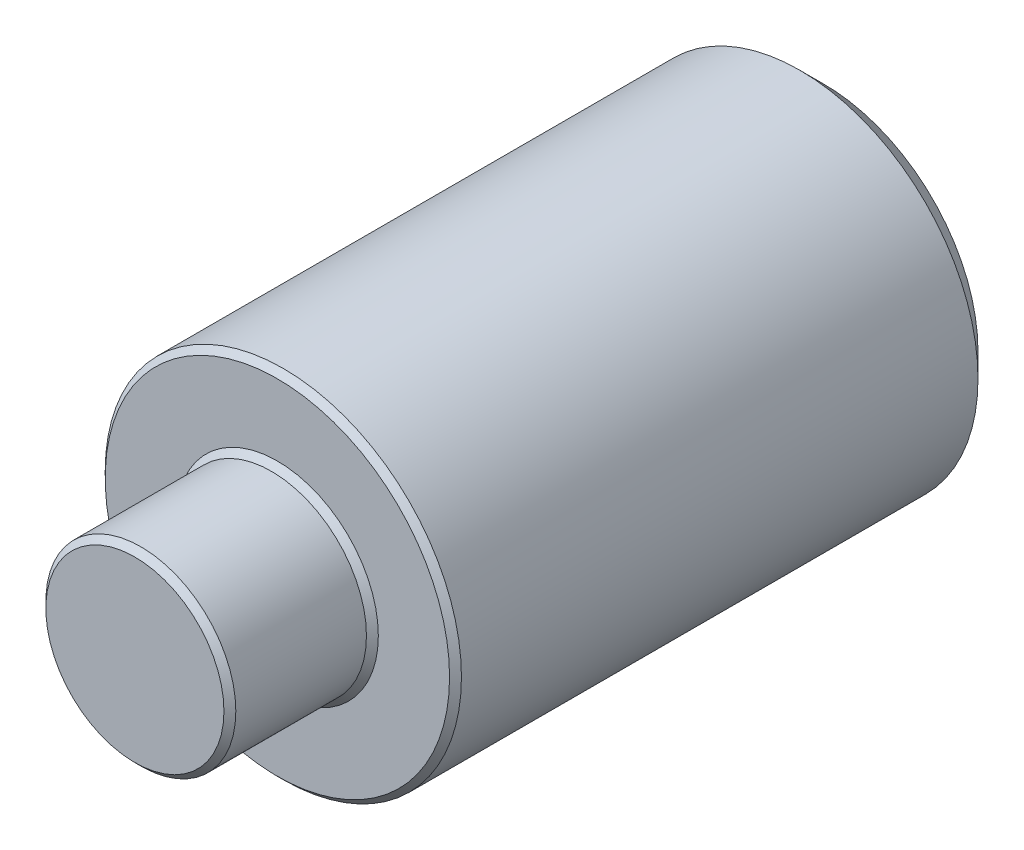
from build123d import *

# Parameters (mm, degrees)
SKETCH_1_R      = 7.5
EXTRUDE_1_DEPTH = 23
SKETCH_2_R      = 4
EXTRUDE_2_DEPTH = 6
CHAMFER_1_SIZE  = 1
CHAMFER_2_SIZE  = 0.25


with BuildPart() as part:
    # Sketch 1 → Extrude 1 (new body)
    with BuildSketch(Plane.XY):
        Circle(SKETCH_1_R)
    extrude(amount=EXTRUDE_1_DEPTH)

    # Sketch 2 → Extrude 2 (add)
    with BuildSketch(Plane.XY.offset(23)):
        Circle(SKETCH_2_R)
    extrude(amount=EXTRUDE_2_DEPTH)

    # Chamfer 1
    chamfer_1_edges = [part.edges().sort_by_distance(p)[0] for p in [
        (-7.5, 0, 0),
    ]]
    chamfer(chamfer_1_edges, length=CHAMFER_1_SIZE)

    # Chamfer 2
    chamfer_2_edges = [part.edges().sort_by_distance(p)[0] for p in [
        (-7.5, 0, 23),
        (-4, 0, 23),
        (-4, 0, 29),
    ]]
    chamfer(chamfer_2_edges, length=CHAMFER_2_SIZE)


solid = part.part
